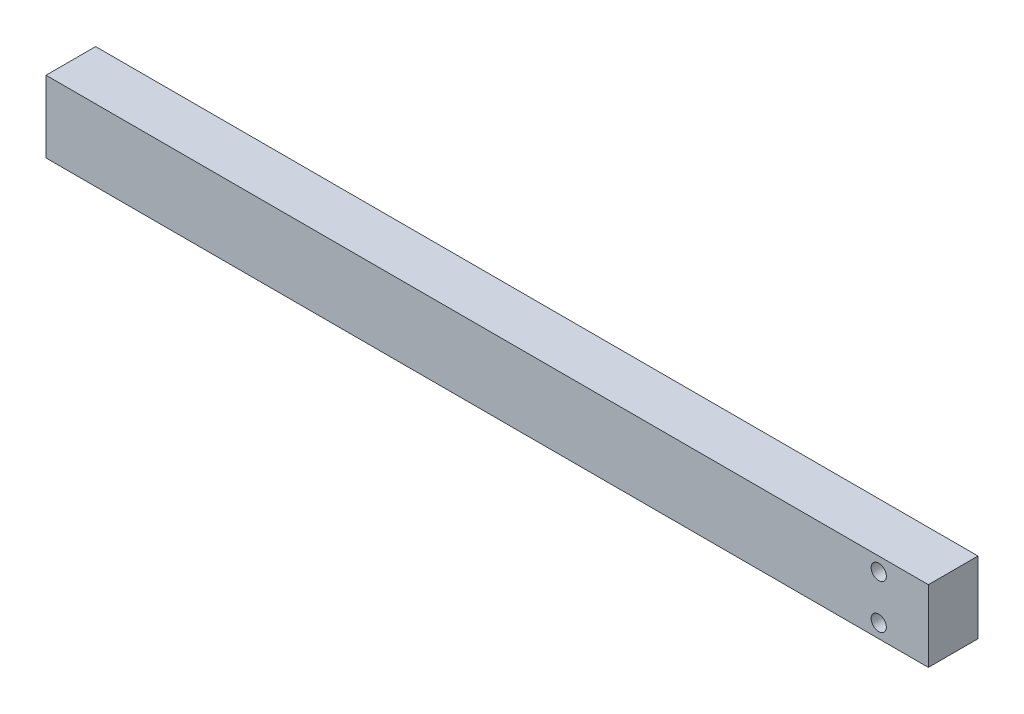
from build123d import *

# Parameters (mm, degrees)
ESQUISSE1_W           = 320
ESQUISSE1_H           = 26
EXTRUSION1_DEPTH      = 18
D_GAGEMENT_M51_D      = 5.5
TROU_TARAUD_M61_D     = 5
TROU_TARAUD_M61_DEPTH = 20
TROU_TARAUD_M61_TIP   = 1.502151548


with BuildPart() as part:
    # Esquisse1 → Extrusion1 (new body)
    with BuildSketch(Plane.XY):
        with Locations((160, 13)):
            Rectangle(ESQUISSE1_W, ESQUISSE1_H)
    extrude(amount=EXTRUSION1_DEPTH)

    # D_gagement M51 (through all)
    with Locations(Plane.XY.offset(18)):
        with Locations((302, 5), (302, 21)):
            Hole(D_GAGEMENT_M51_D / 2)

    # Trou taraud_ M61
    with Locations(Plane.ZY):
        with Locations((9, 20), (9, 6)):
            Hole(TROU_TARAUD_M61_D / 2, depth=TROU_TARAUD_M61_DEPTH)
            with Locations((0, 0, -(TROU_TARAUD_M61_DEPTH + TROU_TARAUD_M61_TIP / 2))):  # 118° drill point
                Cone(0, TROU_TARAUD_M61_D / 2, TROU_TARAUD_M61_TIP, mode=Mode.SUBTRACT)


solid = part.part
